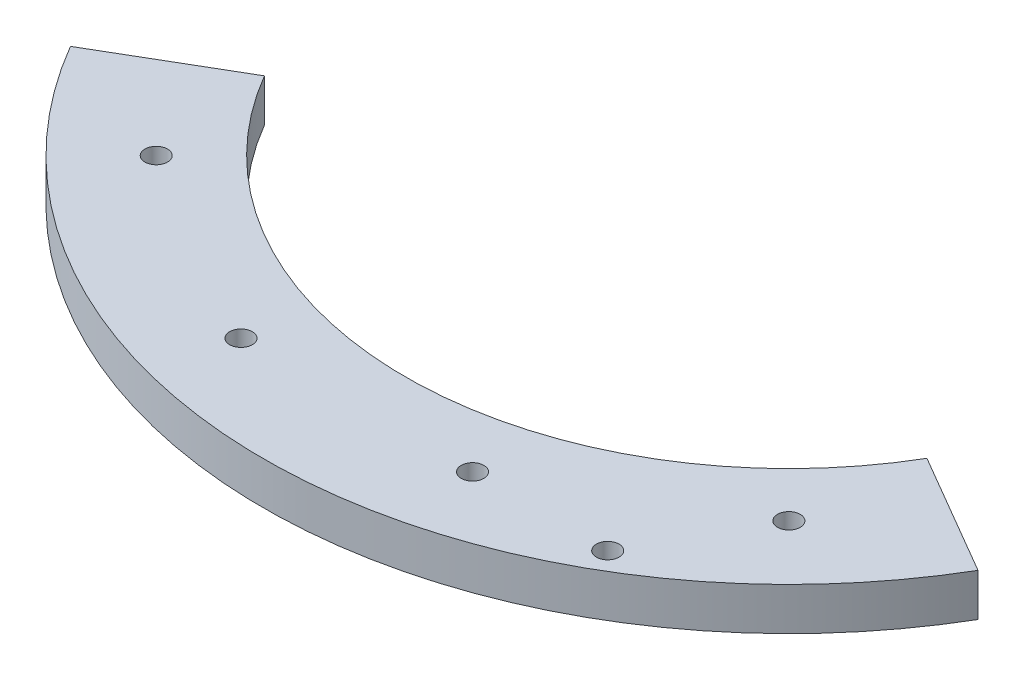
from build123d import *

# Parameters (mm, degrees)
BOSS_EXTRUDE1_DEPTH      = 12.7
H_0_266_DIAMETER_HOLE2_D = 6.7564
H_0_266_DIAMETER_HOLE1_D = 6.7564


with BuildPart() as part:
    # Sketch6 → Boss-Extrude1 (new body)
    with BuildSketch(Plane(origin=(0, 0, 0), x_dir=(1, 0, 0), z_dir=(0, 1, 0))):
        with BuildLine():
            Line((-98.736398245, -57.581365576), (-135.268865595, -78.88647084))
            ThreePointArc((-135.268865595, -78.88647084), (0, -156.591), (135.268865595, -78.88647084))
            Line((135.268865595, -78.88647084), (98.736398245, -57.581365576))
            ThreePointArc((98.736398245, -57.581365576), (0, -114.3), (-98.736398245, -57.581365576))
        make_face()
    extrude(amount=BOSS_EXTRUDE1_DEPTH)

    # H _0.266_ Diameter Hole2 (through all)
    with Locations(Plane(origin=(0, 12.7, 0), x_dir=(1, 0, 0), z_dir=(0, 1, 0))):
        with Locations((74.989533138, -128.986314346), (74.210658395, 129.435997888), (-149.225, 0)):
            Hole(H_0_266_DIAMETER_HOLE2_D / 2)

    # H _0.266_ Diameter Hole1 (through all)
    with Locations(Plane(origin=(0, 12.7, 0), x_dir=(1, 0, 0), z_dir=(0, 1, 0))):
        with Locations((-94.292689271, -94.292689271), (94.292689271, -94.292689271), (-34.513519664, -128.806208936), (34.513519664, -128.806208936)):
            Hole(H_0_266_DIAMETER_HOLE1_D / 2)


solid = part.part
